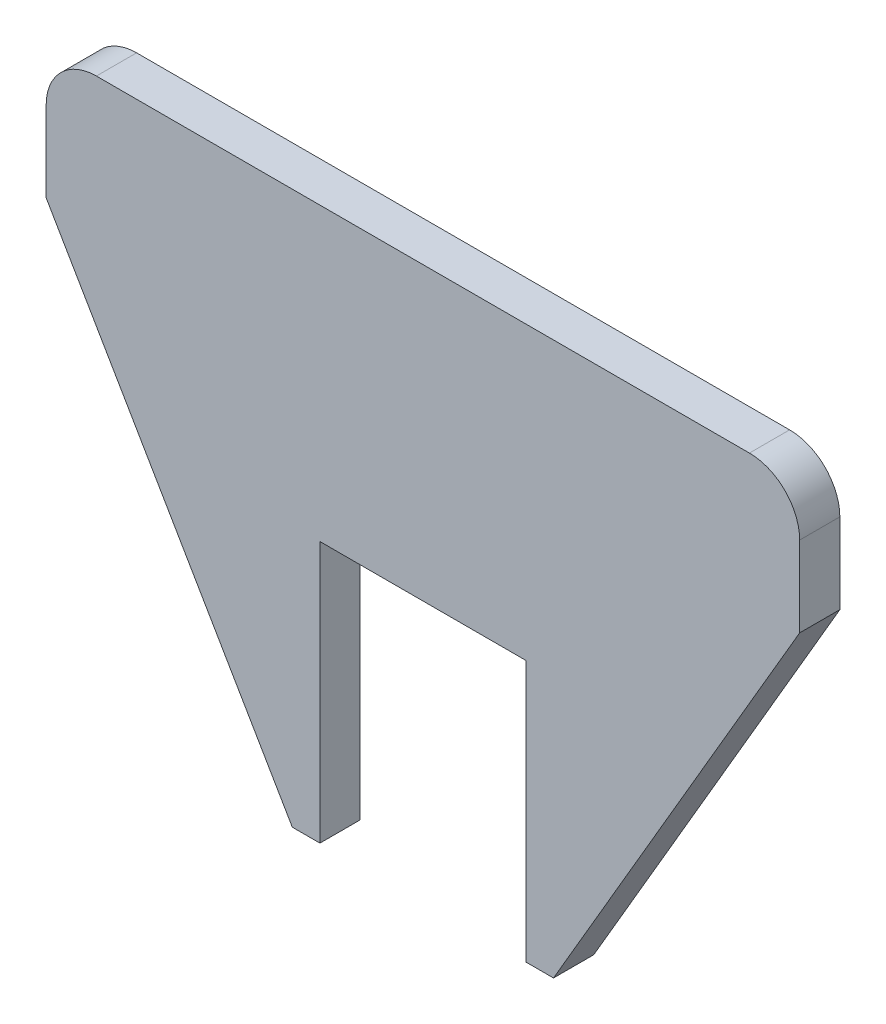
ISO-10303-21;
HEADER;
FILE_DESCRIPTION(('STEP AP214'),'2;1');
FILE_NAME('part.step','',(''),(''),'','','');
FILE_SCHEMA(('AUTOMOTIVE_DESIGN { 1 0 10303 214 1 1 1 1 }'));
ENDSEC;
DATA;
#1=APPLICATION_CONTEXT('core data for automotive mechanical design processes');
#2=APPLICATION_PROTOCOL_DEFINITION('international standard','automotive_design',2000,#1);
#3=PRODUCT_CONTEXT('',#1,'mechanical');
#4=PRODUCT('Part','Part','',(#3));
#5=PRODUCT_RELATED_PRODUCT_CATEGORY('part','',(#4));
#6=PRODUCT_DEFINITION_FORMATION('','',#4);
#7=PRODUCT_DEFINITION_CONTEXT('part definition',#1,'design');
#8=PRODUCT_DEFINITION('design','',#6,#7);
#9=PRODUCT_DEFINITION_SHAPE('','',#8);
#10=(LENGTH_UNIT() NAMED_UNIT(*) SI_UNIT(.MILLI.,.METRE.));
#11=(NAMED_UNIT(*) PLANE_ANGLE_UNIT() SI_UNIT($,.RADIAN.));
#12=(NAMED_UNIT(*) SI_UNIT($,.STERADIAN.) SOLID_ANGLE_UNIT());
#13=UNCERTAINTY_MEASURE_WITH_UNIT(LENGTH_MEASURE(1.E-05),#10,'distance_accuracy_value','');
#14=(GEOMETRIC_REPRESENTATION_CONTEXT(3) GLOBAL_UNCERTAINTY_ASSIGNED_CONTEXT((#13)) GLOBAL_UNIT_ASSIGNED_CONTEXT((#10,
#11,#12)) REPRESENTATION_CONTEXT('',''));
#15=CARTESIAN_POINT('',(0.,0.,0.));
#16=DIRECTION('',(0.,0.,1.));
#17=DIRECTION('',(1.,0.,0.));
#18=AXIS2_PLACEMENT_3D('',#15,#16,#17);
#19=CARTESIAN_POINT('',(47.7500000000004,41.9999999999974,3.99999999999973));
#20=DIRECTION('',(-0.863778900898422,0.50387102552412,0.));
#21=DIRECTION('',(-0.503871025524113,-0.863778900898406,0.));
#22=AXIS2_PLACEMENT_3D('',#19,#20,#21);
#23=PLANE('',#22);
#24=DIRECTION('',(0.503871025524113,0.863778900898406,0.));
#25=VECTOR('',#24,1.);
#26=CARTESIAN_POINT('',(47.7500000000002,41.9999999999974,-3.88578058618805E-13));
#27=LINE('',#26,#25);
#28=CARTESIAN_POINT('',(23.2499999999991,1.22124532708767E-12,-3.33066907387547E-13));
#29=VERTEX_POINT('',#28);
#30=CARTESIAN_POINT('',(47.7500000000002,41.9999999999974,-3.88578058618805E-13));
#31=VERTEX_POINT('',#30);
#32=EDGE_CURVE('E131',#29,#31,#27,.T.);
#33=ORIENTED_EDGE('',*,*,#32,.T.);
#34=DIRECTION('',(0.,0.,-0.999999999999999));
#35=VECTOR('',#34,1.);
#36=CARTESIAN_POINT('',(47.7500000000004,41.9999999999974,3.99999999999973));
#37=LINE('',#36,#35);
#38=CARTESIAN_POINT('',(47.7500000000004,41.9999999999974,3.99999999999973));
#39=VERTEX_POINT('',#38);
#40=EDGE_CURVE('E11',#39,#31,#37,.T.);
#41=ORIENTED_EDGE('',*,*,#40,.F.);
#42=DIRECTION('',(0.503871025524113,0.863778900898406,0.));
#43=VECTOR('',#42,1.);
#44=CARTESIAN_POINT('',(47.7500000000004,41.9999999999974,3.99999999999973));
#45=LINE('',#44,#43);
#46=CARTESIAN_POINT('',(23.2499999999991,1.22124532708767E-12,3.9999999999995));
#47=VERTEX_POINT('',#46);
#48=EDGE_CURVE('E180',#47,#39,#45,.T.);
#49=ORIENTED_EDGE('',*,*,#48,.F.);
#50=DIRECTION('',(0.,0.,-0.999999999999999));
#51=VECTOR('',#50,1.);
#52=CARTESIAN_POINT('',(23.2499999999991,1.22124532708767E-12,3.9999999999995));
#53=LINE('',#52,#51);
#54=EDGE_CURVE('E145',#47,#29,#53,.T.);
#55=ORIENTED_EDGE('',*,*,#54,.T.);
#56=EDGE_LOOP('',(#33,#41,#49,#55));
#57=FACE_BOUND('',#56,.T.);
#58=ADVANCED_FACE('F38',(#57),#23,.F.);
#59=CARTESIAN_POINT('',(47.7500000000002,50.0000000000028,3.99999999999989));
#60=DIRECTION('',(-1.,0.,0.));
#61=DIRECTION('',(0.,0.,0.999999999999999));
#62=AXIS2_PLACEMENT_3D('',#59,#60,#61);
#63=PLANE('',#62);
#64=DIRECTION('',(0.,0.999999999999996,0.));
#65=VECTOR('',#64,1.);
#66=CARTESIAN_POINT('',(47.7500000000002,50.0000000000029,0.));
#67=LINE('',#66,#65);
#68=CARTESIAN_POINT('',(47.7500000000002,50.0000000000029,0.));
#69=VERTEX_POINT('',#68);
#70=EDGE_CURVE('E127',#31,#69,#67,.T.);
#71=ORIENTED_EDGE('',*,*,#70,.T.);
#72=DIRECTION('',(0.,0.,-0.999999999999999));
#73=VECTOR('',#72,1.);
#74=CARTESIAN_POINT('',(47.7500000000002,50.0000000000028,3.99999999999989));
#75=LINE('',#74,#73);
#76=CARTESIAN_POINT('',(47.7500000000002,50.0000000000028,3.99999999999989));
#77=VERTEX_POINT('',#76);
#78=EDGE_CURVE('E46',#77,#69,#75,.T.);
#79=ORIENTED_EDGE('',*,*,#78,.F.);
#80=DIRECTION('',(0.,0.999999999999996,0.));
#81=VECTOR('',#80,1.);
#82=CARTESIAN_POINT('',(47.7500000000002,50.0000000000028,3.99999999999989));
#83=LINE('',#82,#81);
#84=EDGE_CURVE('E141',#39,#77,#83,.T.);
#85=ORIENTED_EDGE('',*,*,#84,.F.);
#86=ORIENTED_EDGE('',*,*,#40,.T.);
#87=EDGE_LOOP('',(#71,#79,#85,#86));
#88=FACE_BOUND('',#87,.T.);
#89=ADVANCED_FACE('F140',(#88),#63,.F.);
#90=CARTESIAN_POINT('',(42.7500000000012,50.000000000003,4.));
#91=DIRECTION('',(0.,0.,-0.999999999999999));
#92=DIRECTION('',(-1.,0.,0.));
#93=AXIS2_PLACEMENT_3D('',#90,#91,#92);
#94=CYLINDRICAL_SURFACE('',#93,4.99999999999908);
#95=CARTESIAN_POINT('',(42.7500000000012,50.0000000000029,1.11022302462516E-13));
#96=DIRECTION('',(0.,0.,0.999999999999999));
#97=DIRECTION('',(1.,0.,0.));
#98=AXIS2_PLACEMENT_3D('',#95,#96,#97);
#99=CIRCLE('',#98,4.99999999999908);
#100=CARTESIAN_POINT('',(42.7499999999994,55.0000000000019,2.22044604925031E-13));
#101=VERTEX_POINT('',#100);
#102=EDGE_CURVE('E133',#69,#101,#99,.T.);
#103=ORIENTED_EDGE('',*,*,#102,.T.);
#104=DIRECTION('',(0.,0.,-0.999999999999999));
#105=VECTOR('',#104,1.);
#106=CARTESIAN_POINT('',(42.7499999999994,55.0000000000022,4.));
#107=LINE('',#106,#105);
#108=CARTESIAN_POINT('',(42.7499999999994,55.0000000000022,4.));
#109=VERTEX_POINT('',#108);
#110=EDGE_CURVE('E245',#109,#101,#107,.T.);
#111=ORIENTED_EDGE('',*,*,#110,.F.);
#112=CARTESIAN_POINT('',(42.7500000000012,50.000000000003,4.));
#113=DIRECTION('',(0.,0.,0.999999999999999));
#114=DIRECTION('',(1.,0.,0.));
#115=AXIS2_PLACEMENT_3D('',#112,#113,#114);
#116=CIRCLE('',#115,4.99999999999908);
#117=EDGE_CURVE('E185',#77,#109,#116,.T.);
#118=ORIENTED_EDGE('',*,*,#117,.F.);
#119=ORIENTED_EDGE('',*,*,#78,.T.);
#120=EDGE_LOOP('',(#103,#111,#118,#119));
#121=FACE_BOUND('',#120,.T.);
#122=ADVANCED_FACE('F251',(#121),#94,.T.);
#123=CARTESIAN_POINT('',(42.7499999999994,55.0000000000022,4.));
#124=DIRECTION('',(0.,-0.999999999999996,0.));
#125=DIRECTION('',(0.,0.,-0.999999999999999));
#126=AXIS2_PLACEMENT_3D('',#123,#124,#125);
#127=PLANE('',#126);
#128=DIRECTION('',(-1.,0.,0.));
#129=VECTOR('',#128,1.);
#130=CARTESIAN_POINT('',(42.7499999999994,55.0000000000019,2.22044604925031E-13));
#131=LINE('',#130,#129);
#132=CARTESIAN_POINT('',(-22.250000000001,55.0000000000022,0.));
#133=VERTEX_POINT('',#132);
#134=EDGE_CURVE('E153',#101,#133,#131,.T.);
#135=ORIENTED_EDGE('',*,*,#134,.T.);
#136=DIRECTION('',(0.,0.,-0.999999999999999));
#137=VECTOR('',#136,1.);
#138=CARTESIAN_POINT('',(-22.2500000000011,55.0000000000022,3.99999999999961));
#139=LINE('',#138,#137);
#140=CARTESIAN_POINT('',(-22.2500000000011,55.0000000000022,3.99999999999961));
#141=VERTEX_POINT('',#140);
#142=EDGE_CURVE('E241',#141,#133,#139,.T.);
#143=ORIENTED_EDGE('',*,*,#142,.F.);
#144=DIRECTION('',(-1.,0.,0.));
#145=VECTOR('',#144,1.);
#146=CARTESIAN_POINT('',(42.7499999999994,55.0000000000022,4.));
#147=LINE('',#146,#145);
#148=EDGE_CURVE('E188',#109,#141,#147,.T.);
#149=ORIENTED_EDGE('',*,*,#148,.F.);
#150=ORIENTED_EDGE('',*,*,#110,.T.);
#151=EDGE_LOOP('',(#135,#143,#149,#150));
#152=FACE_BOUND('',#151,.T.);
#153=ADVANCED_FACE('F259',(#152),#127,.F.);
#154=CARTESIAN_POINT('',(-22.2499999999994,50.0000000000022,3.99999999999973));
#155=DIRECTION('',(0.,0.,-0.999999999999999));
#156=DIRECTION('',(-1.,0.,0.));
#157=AXIS2_PLACEMENT_3D('',#154,#155,#156);
#158=CYLINDRICAL_SURFACE('',#157,5.);
#159=CARTESIAN_POINT('',(-22.2499999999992,50.0000000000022,0.));
#160=DIRECTION('',(0.,0.,0.999999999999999));
#161=DIRECTION('',(1.,0.,0.));
#162=AXIS2_PLACEMENT_3D('',#159,#160,#161);
#163=CIRCLE('',#162,5.);
#164=CARTESIAN_POINT('',(-27.2499999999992,50.0000000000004,0.));
#165=VERTEX_POINT('',#164);
#166=EDGE_CURVE('E156',#133,#165,#163,.T.);
#167=ORIENTED_EDGE('',*,*,#166,.T.);
#168=DIRECTION('',(0.,0.,-0.999999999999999));
#169=VECTOR('',#168,1.);
#170=CARTESIAN_POINT('',(-27.2499999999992,50.0000000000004,3.99999999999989));
#171=LINE('',#170,#169);
#172=CARTESIAN_POINT('',(-27.2499999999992,50.0000000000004,3.99999999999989));
#173=VERTEX_POINT('',#172);
#174=EDGE_CURVE('E237',#173,#165,#171,.T.);
#175=ORIENTED_EDGE('',*,*,#174,.F.);
#176=CARTESIAN_POINT('',(-22.2499999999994,50.0000000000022,3.99999999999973));
#177=DIRECTION('',(0.,0.,0.999999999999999));
#178=DIRECTION('',(1.,0.,0.));
#179=AXIS2_PLACEMENT_3D('',#176,#177,#178);
#180=CIRCLE('',#179,5.);
#181=EDGE_CURVE('E191',#141,#173,#180,.T.);
#182=ORIENTED_EDGE('',*,*,#181,.F.);
#183=ORIENTED_EDGE('',*,*,#142,.T.);
#184=EDGE_LOOP('',(#167,#175,#182,#183));
#185=FACE_BOUND('',#184,.T.);
#186=ADVANCED_FACE('F262',(#185),#158,.T.);
#187=CARTESIAN_POINT('',(-27.2499999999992,50.0000000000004,3.99999999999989));
#188=DIRECTION('',(1.,0.,0.));
#189=DIRECTION('',(0.,0.,-0.999999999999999));
#190=AXIS2_PLACEMENT_3D('',#187,#188,#189);
#191=PLANE('',#190);
#192=DIRECTION('',(0.,-0.999999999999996,0.));
#193=VECTOR('',#192,1.);
#194=CARTESIAN_POINT('',(-27.2499999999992,50.0000000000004,0.));
#195=LINE('',#194,#193);
#196=CARTESIAN_POINT('',(-27.249999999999,42.0000000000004,-3.88578058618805E-13));
#197=VERTEX_POINT('',#196);
#198=EDGE_CURVE('E159',#165,#197,#195,.T.);
#199=ORIENTED_EDGE('',*,*,#198,.T.);
#200=DIRECTION('',(0.,0.,-0.999999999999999));
#201=VECTOR('',#200,1.);
#202=CARTESIAN_POINT('',(-27.2499999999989,42.0000000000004,3.99999999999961));
#203=LINE('',#202,#201);
#204=CARTESIAN_POINT('',(-27.2499999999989,42.0000000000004,3.99999999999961));
#205=VERTEX_POINT('',#204);
#206=EDGE_CURVE('E233',#205,#197,#203,.T.);
#207=ORIENTED_EDGE('',*,*,#206,.F.);
#208=DIRECTION('',(0.,-0.999999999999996,0.));
#209=VECTOR('',#208,1.);
#210=CARTESIAN_POINT('',(-27.2499999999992,50.0000000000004,3.99999999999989));
#211=LINE('',#210,#209);
#212=EDGE_CURVE('E194',#173,#205,#211,.T.);
#213=ORIENTED_EDGE('',*,*,#212,.F.);
#214=ORIENTED_EDGE('',*,*,#174,.T.);
#215=EDGE_LOOP('',(#199,#207,#213,#214));
#216=FACE_BOUND('',#215,.T.);
#217=ADVANCED_FACE('F267',(#216),#191,.F.);
#218=CARTESIAN_POINT('',(-27.2499999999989,42.0000000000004,3.99999999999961));
#219=DIRECTION('',(0.863778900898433,0.503871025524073,0.));
#220=DIRECTION('',(-0.503871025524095,0.863778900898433,0.));
#221=AXIS2_PLACEMENT_3D('',#218,#219,#220);
#222=PLANE('',#221);
#223=DIRECTION('',(0.503871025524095,-0.863778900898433,0.));
#224=VECTOR('',#223,1.);
#225=CARTESIAN_POINT('',(-27.249999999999,42.0000000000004,-3.88578058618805E-13));
#226=LINE('',#225,#224);
#227=CARTESIAN_POINT('',(-2.75000000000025,0.,0.));
#228=VERTEX_POINT('',#227);
#229=EDGE_CURVE('E162',#197,#228,#226,.T.);
#230=ORIENTED_EDGE('',*,*,#229,.T.);
#231=DIRECTION('',(0.,0.,-0.999999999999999));
#232=VECTOR('',#231,1.);
#233=CARTESIAN_POINT('',(-2.75000000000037,0.,3.99999999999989));
#234=LINE('',#233,#232);
#235=CARTESIAN_POINT('',(-2.75000000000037,0.,3.99999999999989));
#236=VERTEX_POINT('',#235);
#237=EDGE_CURVE('E229',#236,#228,#234,.T.);
#238=ORIENTED_EDGE('',*,*,#237,.F.);
#239=DIRECTION('',(0.503871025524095,-0.863778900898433,0.));
#240=VECTOR('',#239,1.);
#241=CARTESIAN_POINT('',(-27.2499999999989,42.0000000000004,3.99999999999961));
#242=LINE('',#241,#240);
#243=EDGE_CURVE('E197',#205,#236,#242,.T.);
#244=ORIENTED_EDGE('',*,*,#243,.F.);
#245=ORIENTED_EDGE('',*,*,#206,.T.);
#246=EDGE_LOOP('',(#230,#238,#244,#245));
#247=FACE_BOUND('',#246,.T.);
#248=ADVANCED_FACE('F273',(#247),#222,.F.);
#249=CARTESIAN_POINT('',(-1.13624387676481E-13,0.,3.99999999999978));
#250=DIRECTION('',(0.,0.999999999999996,0.));
#251=DIRECTION('',(0.,0.,0.999999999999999));
#252=AXIS2_PLACEMENT_3D('',#249,#250,#251);
#253=PLANE('',#252);
#254=DIRECTION('',(1.,0.,0.));
#255=VECTOR('',#254,1.);
#256=CARTESIAN_POINT('',(0.,0.,-1.11022302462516E-13));
#257=LINE('',#256,#255);
#258=CARTESIAN_POINT('',(0.,0.,-1.11022302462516E-13));
#259=VERTEX_POINT('',#258);
#260=EDGE_CURVE('E165',#228,#259,#257,.T.);
#261=ORIENTED_EDGE('',*,*,#260,.T.);
#262=DIRECTION('',(0.,0.,-0.999999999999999));
#263=VECTOR('',#262,1.);
#264=CARTESIAN_POINT('',(-1.13624387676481E-13,0.,3.99999999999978));
#265=LINE('',#264,#263);
#266=CARTESIAN_POINT('',(-1.13624387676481E-13,0.,3.99999999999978));
#267=VERTEX_POINT('',#266);
#268=EDGE_CURVE('E225',#267,#259,#265,.T.);
#269=ORIENTED_EDGE('',*,*,#268,.F.);
#270=DIRECTION('',(1.,0.,0.));
#271=VECTOR('',#270,1.);
#272=CARTESIAN_POINT('',(-1.13624387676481E-13,0.,3.99999999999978));
#273=LINE('',#272,#271);
#274=EDGE_CURVE('E199',#236,#267,#273,.T.);
#275=ORIENTED_EDGE('',*,*,#274,.F.);
#276=ORIENTED_EDGE('',*,*,#237,.T.);
#277=EDGE_LOOP('',(#261,#269,#275,#276));
#278=FACE_BOUND('',#277,.T.);
#279=ADVANCED_FACE('F277',(#278),#253,.F.);
#280=CARTESIAN_POINT('',(-2.34187669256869E-13,25.9999999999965,3.99999999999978));
#281=DIRECTION('',(-1.,0.,0.));
#282=DIRECTION('',(0.,0.,0.999999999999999));
#283=AXIS2_PLACEMENT_3D('',#280,#281,#282);
#284=PLANE('',#283);
#285=DIRECTION('',(0.,0.999999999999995,0.));
#286=VECTOR('',#285,1.);
#287=CARTESIAN_POINT('',(-3.43475248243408E-13,25.9999999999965,0.));
#288=LINE('',#287,#286);
#289=CARTESIAN_POINT('',(-3.43475248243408E-13,25.9999999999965,0.));
#290=VERTEX_POINT('',#289);
#291=EDGE_CURVE('E168',#259,#290,#288,.T.);
#292=ORIENTED_EDGE('',*,*,#291,.T.);
#293=DIRECTION('',(0.,0.,-0.999999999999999));
#294=VECTOR('',#293,1.);
#295=CARTESIAN_POINT('',(-2.34187669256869E-13,25.9999999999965,3.99999999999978));
#296=LINE('',#295,#294);
#297=CARTESIAN_POINT('',(-2.34187669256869E-13,25.9999999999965,3.99999999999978));
#298=VERTEX_POINT('',#297);
#299=EDGE_CURVE('E221',#298,#290,#296,.T.);
#300=ORIENTED_EDGE('',*,*,#299,.F.);
#301=DIRECTION('',(0.,0.999999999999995,0.));
#302=VECTOR('',#301,1.);
#303=CARTESIAN_POINT('',(-2.34187669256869E-13,25.9999999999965,3.99999999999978));
#304=LINE('',#303,#302);
#305=EDGE_CURVE('E202',#267,#298,#304,.T.);
#306=ORIENTED_EDGE('',*,*,#305,.F.);
#307=ORIENTED_EDGE('',*,*,#268,.T.);
#308=EDGE_LOOP('',(#292,#300,#306,#307));
#309=FACE_BOUND('',#308,.T.);
#310=ADVANCED_FACE('F282',(#309),#284,.F.);
#311=CARTESIAN_POINT('',(20.4999999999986,25.9999999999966,3.99999999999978));
#312=DIRECTION('',(0.,0.999999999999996,0.));
#313=DIRECTION('',(0.,0.,0.999999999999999));
#314=AXIS2_PLACEMENT_3D('',#311,#312,#313);
#315=PLANE('',#314);
#316=DIRECTION('',(1.,0.,0.));
#317=VECTOR('',#316,1.);
#318=CARTESIAN_POINT('',(20.4999999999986,25.9999999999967,-2.77555756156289E-13));
#319=LINE('',#318,#317);
#320=CARTESIAN_POINT('',(20.4999999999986,25.9999999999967,-2.77555756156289E-13));
#321=VERTEX_POINT('',#320);
#322=EDGE_CURVE('E171',#290,#321,#319,.T.);
#323=ORIENTED_EDGE('',*,*,#322,.T.);
#324=DIRECTION('',(0.,0.,-0.999999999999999));
#325=VECTOR('',#324,1.);
#326=CARTESIAN_POINT('',(20.4999999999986,25.9999999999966,3.99999999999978));
#327=LINE('',#326,#325);
#328=CARTESIAN_POINT('',(20.4999999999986,25.9999999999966,3.99999999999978));
#329=VERTEX_POINT('',#328);
#330=EDGE_CURVE('E217',#329,#321,#327,.T.);
#331=ORIENTED_EDGE('',*,*,#330,.F.);
#332=DIRECTION('',(1.,0.,0.));
#333=VECTOR('',#332,1.);
#334=CARTESIAN_POINT('',(20.4999999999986,25.9999999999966,3.99999999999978));
#335=LINE('',#334,#333);
#336=EDGE_CURVE('E205',#298,#329,#335,.T.);
#337=ORIENTED_EDGE('',*,*,#336,.F.);
#338=ORIENTED_EDGE('',*,*,#299,.T.);
#339=EDGE_LOOP('',(#323,#331,#337,#338));
#340=FACE_BOUND('',#339,.T.);
#341=ADVANCED_FACE('F286',(#340),#315,.F.);
#342=CARTESIAN_POINT('',(20.4999999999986,25.9999999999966,3.99999999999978));
#343=DIRECTION('',(1.,0.,0.));
#344=DIRECTION('',(0.,0.,-0.999999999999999));
#345=AXIS2_PLACEMENT_3D('',#342,#343,#344);
#346=PLANE('',#345);
#347=DIRECTION('',(0.,-0.999999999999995,0.));
#348=VECTOR('',#347,1.);
#349=CARTESIAN_POINT('',(20.4999999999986,25.9999999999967,-2.77555756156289E-13));
#350=LINE('',#349,#348);
#351=CARTESIAN_POINT('',(20.4999999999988,1.22124532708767E-12,-2.77555756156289E-13));
#352=VERTEX_POINT('',#351);
#353=EDGE_CURVE('E174',#321,#352,#350,.T.);
#354=ORIENTED_EDGE('',*,*,#353,.T.);
#355=DIRECTION('',(0.,0.,-0.999999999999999));
#356=VECTOR('',#355,1.);
#357=CARTESIAN_POINT('',(20.4999999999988,1.22124532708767E-12,3.99999999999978));
#358=LINE('',#357,#356);
#359=CARTESIAN_POINT('',(20.4999999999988,1.22124532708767E-12,3.99999999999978));
#360=VERTEX_POINT('',#359);
#361=EDGE_CURVE('E213',#360,#352,#358,.T.);
#362=ORIENTED_EDGE('',*,*,#361,.F.);
#363=DIRECTION('',(0.,-0.999999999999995,0.));
#364=VECTOR('',#363,1.);
#365=CARTESIAN_POINT('',(20.4999999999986,25.9999999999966,3.99999999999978));
#366=LINE('',#365,#364);
#367=EDGE_CURVE('E58',#329,#360,#366,.T.);
#368=ORIENTED_EDGE('',*,*,#367,.F.);
#369=ORIENTED_EDGE('',*,*,#330,.T.);
#370=EDGE_LOOP('',(#354,#362,#368,#369));
#371=FACE_BOUND('',#370,.T.);
#372=ADVANCED_FACE('F290',(#371),#346,.F.);
#373=CARTESIAN_POINT('',(23.2499999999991,1.22124532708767E-12,3.9999999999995));
#374=DIRECTION('',(0.,0.999999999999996,0.));
#375=DIRECTION('',(0.,0.,0.999999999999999));
#376=AXIS2_PLACEMENT_3D('',#373,#374,#375);
#377=PLANE('',#376);
#378=DIRECTION('',(1.,0.,0.));
#379=VECTOR('',#378,1.);
#380=CARTESIAN_POINT('',(23.2499999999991,1.22124532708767E-12,-3.33066907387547E-13));
#381=LINE('',#380,#379);
#382=EDGE_CURVE('E177',#352,#29,#381,.T.);
#383=ORIENTED_EDGE('',*,*,#382,.T.);
#384=ORIENTED_EDGE('',*,*,#54,.F.);
#385=DIRECTION('',(1.,0.,0.));
#386=VECTOR('',#385,1.);
#387=CARTESIAN_POINT('',(23.2499999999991,1.22124532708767E-12,3.9999999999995));
#388=LINE('',#387,#386);
#389=EDGE_CURVE('E53',#360,#47,#388,.T.);
#390=ORIENTED_EDGE('',*,*,#389,.F.);
#391=ORIENTED_EDGE('',*,*,#361,.T.);
#392=EDGE_LOOP('',(#383,#384,#390,#391));
#393=FACE_BOUND('',#392,.T.);
#394=ADVANCED_FACE('F292',(#393),#377,.F.);
#395=CARTESIAN_POINT('',(-22.2499999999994,50.0000000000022,3.99999999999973));
#396=DIRECTION('',(0.,0.,0.999999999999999));
#397=DIRECTION('',(1.,0.,0.));
#398=AXIS2_PLACEMENT_3D('',#395,#396,#397);
#399=PLANE('',#398);
#400=ORIENTED_EDGE('',*,*,#48,.T.);
#401=ORIENTED_EDGE('',*,*,#84,.T.);
#402=ORIENTED_EDGE('',*,*,#117,.T.);
#403=ORIENTED_EDGE('',*,*,#148,.T.);
#404=ORIENTED_EDGE('',*,*,#181,.T.);
#405=ORIENTED_EDGE('',*,*,#212,.T.);
#406=ORIENTED_EDGE('',*,*,#243,.T.);
#407=ORIENTED_EDGE('',*,*,#274,.T.);
#408=ORIENTED_EDGE('',*,*,#305,.T.);
#409=ORIENTED_EDGE('',*,*,#336,.T.);
#410=ORIENTED_EDGE('',*,*,#367,.T.);
#411=ORIENTED_EDGE('',*,*,#389,.T.);
#412=EDGE_LOOP('',(#400,#401,#402,#403,#404,#405,#406,#407,#408,#409,#410,#411));
#413=FACE_BOUND('',#412,.T.);
#414=ADVANCED_FACE('F254',(#413),#399,.T.);
#415=CARTESIAN_POINT('',(-22.2499999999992,50.0000000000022,0.));
#416=DIRECTION('',(0.,0.,0.999999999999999));
#417=DIRECTION('',(1.,0.,0.));
#418=AXIS2_PLACEMENT_3D('',#415,#416,#417);
#419=PLANE('',#418);
#420=ORIENTED_EDGE('',*,*,#32,.F.);
#421=ORIENTED_EDGE('',*,*,#382,.F.);
#422=ORIENTED_EDGE('',*,*,#353,.F.);
#423=ORIENTED_EDGE('',*,*,#322,.F.);
#424=ORIENTED_EDGE('',*,*,#291,.F.);
#425=ORIENTED_EDGE('',*,*,#260,.F.);
#426=ORIENTED_EDGE('',*,*,#229,.F.);
#427=ORIENTED_EDGE('',*,*,#198,.F.);
#428=ORIENTED_EDGE('',*,*,#166,.F.);
#429=ORIENTED_EDGE('',*,*,#134,.F.);
#430=ORIENTED_EDGE('',*,*,#102,.F.);
#431=ORIENTED_EDGE('',*,*,#70,.F.);
#432=EDGE_LOOP('',(#420,#421,#422,#423,#424,#425,#426,#427,#428,#429,#430,#431));
#433=FACE_BOUND('',#432,.T.);
#434=ADVANCED_FACE('F128',(#433),#419,.F.);
#435=CLOSED_SHELL('',(#58,#89,#122,#153,#186,#217,#248,#279,#310,#341,#372,#394,#414,#434));
#436=MANIFOLD_SOLID_BREP('B2',#435);
#437=ADVANCED_BREP_SHAPE_REPRESENTATION('',(#18,#436),#14);
#438=SHAPE_DEFINITION_REPRESENTATION(#9,#437);
ENDSEC;
END-ISO-10303-21;
